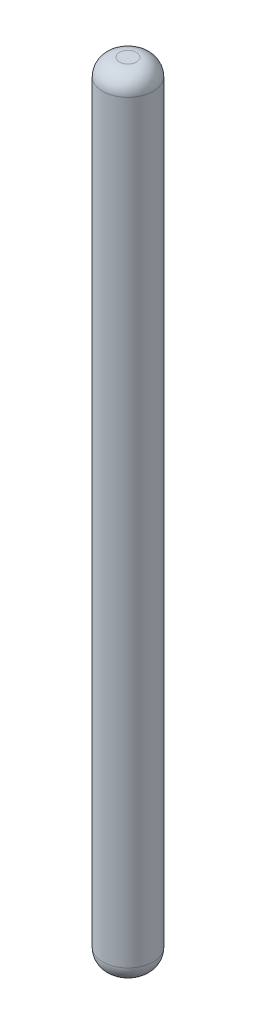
from build123d import *

# Parameters (mm, degrees)
SKETCH1_R           = 4.5
BOSS_EXTRUDE1_DEPTH = 140
FILLET1_R           = 3


with BuildPart() as part:
    # Sketch1 → Boss-Extrude1 (new body)
    with BuildSketch(Plane(origin=(0, 0, 0), x_dir=(1, 0, 0), z_dir=(0, 1, 0))):
        with Locations(Location((0, 0, 0), (0, 0, 270))):
            Circle(SKETCH1_R)
    extrude(amount=BOSS_EXTRUDE1_DEPTH)

    # Fillet1
    fillet1_edges = [part.edges().sort_by_distance(p)[0] for p in [
        (0, 0, -4.5),
        (0, 140, -4.5),
    ]]
    fillet(fillet1_edges, radius=FILLET1_R)


solid = part.part
